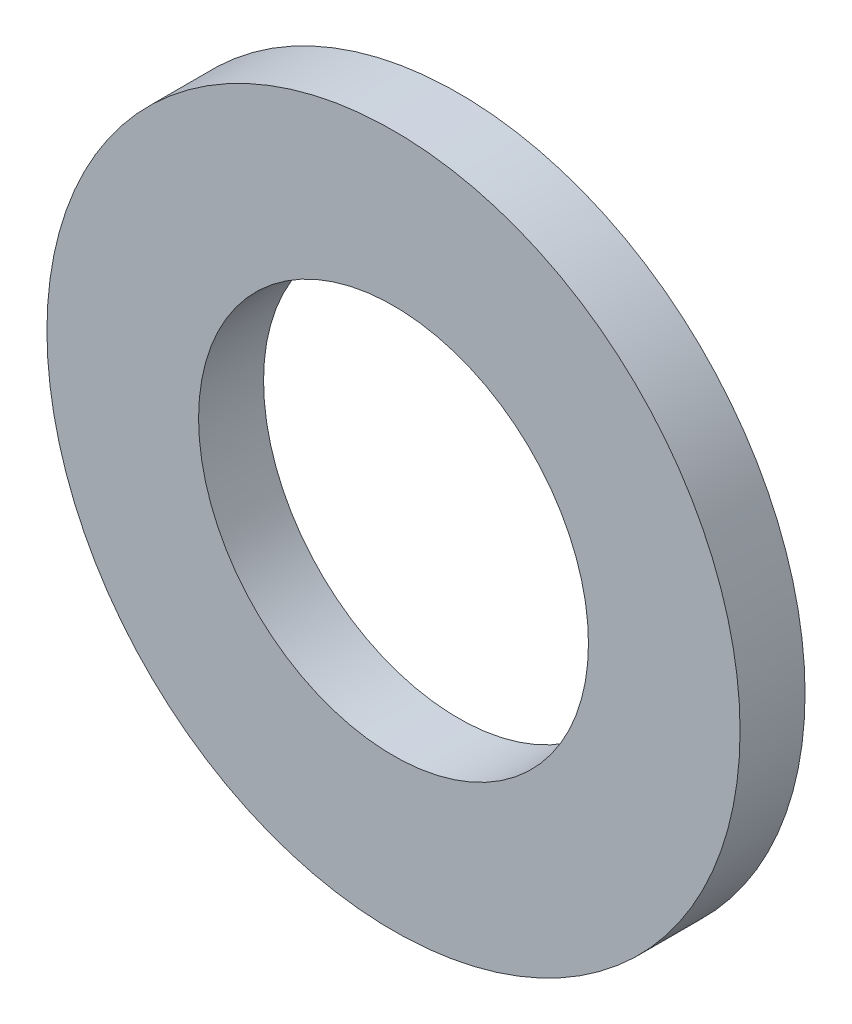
ISO-10303-21;
HEADER;
FILE_DESCRIPTION(('STEP AP214'),'2;1');
FILE_NAME('part.step','',(''),(''),'','','');
FILE_SCHEMA(('AUTOMOTIVE_DESIGN { 1 0 10303 214 1 1 1 1 }'));
ENDSEC;
DATA;
#1=APPLICATION_CONTEXT('core data for automotive mechanical design processes');
#2=APPLICATION_PROTOCOL_DEFINITION('international standard','automotive_design',2000,#1);
#3=PRODUCT_CONTEXT('',#1,'mechanical');
#4=PRODUCT('Part','Part','',(#3));
#5=PRODUCT_RELATED_PRODUCT_CATEGORY('part','',(#4));
#6=PRODUCT_DEFINITION_FORMATION('','',#4);
#7=PRODUCT_DEFINITION_CONTEXT('part definition',#1,'design');
#8=PRODUCT_DEFINITION('design','',#6,#7);
#9=PRODUCT_DEFINITION_SHAPE('','',#8);
#10=(LENGTH_UNIT() NAMED_UNIT(*) SI_UNIT(.MILLI.,.METRE.));
#11=(NAMED_UNIT(*) PLANE_ANGLE_UNIT() SI_UNIT($,.RADIAN.));
#12=(NAMED_UNIT(*) SI_UNIT($,.STERADIAN.) SOLID_ANGLE_UNIT());
#13=UNCERTAINTY_MEASURE_WITH_UNIT(LENGTH_MEASURE(1.E-05),#10,'distance_accuracy_value','');
#14=(GEOMETRIC_REPRESENTATION_CONTEXT(3) GLOBAL_UNCERTAINTY_ASSIGNED_CONTEXT((#13)) GLOBAL_UNIT_ASSIGNED_CONTEXT((#10,
#11,#12)) REPRESENTATION_CONTEXT('',''));
#15=CARTESIAN_POINT('',(0.,0.,0.));
#16=DIRECTION('',(0.,0.,1.));
#17=DIRECTION('',(1.,0.,0.));
#18=AXIS2_PLACEMENT_3D('',#15,#16,#17);
#19=CARTESIAN_POINT('',(0.,0.,-3.));
#20=DIRECTION('',(0.,0.,1.));
#21=DIRECTION('',(1.,0.,0.));
#22=AXIS2_PLACEMENT_3D('',#19,#20,#21);
#23=CYLINDRICAL_SURFACE('',#22,16.);
#24=CARTESIAN_POINT('',(0.,0.,-3.));
#25=DIRECTION('',(0.,0.,1.));
#26=DIRECTION('',(1.,0.,0.));
#27=AXIS2_PLACEMENT_3D('',#24,#25,#26);
#28=CIRCLE('',#27,16.);
#29=CARTESIAN_POINT('',(16.0000000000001,0.,-3.));
#30=VERTEX_POINT('',#29);
#31=EDGE_CURVE('E10',#30,#30,#28,.T.);
#32=ORIENTED_EDGE('',*,*,#31,.T.);
#33=EDGE_LOOP('',(#32));
#34=FACE_BOUND('',#33,.T.);
#35=CARTESIAN_POINT('',(0.,0.,0.));
#36=DIRECTION('',(0.,0.,1.));
#37=DIRECTION('',(1.,0.,0.));
#38=AXIS2_PLACEMENT_3D('',#35,#36,#37);
#39=CIRCLE('',#38,16.);
#40=CARTESIAN_POINT('',(16.0000000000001,0.,0.));
#41=VERTEX_POINT('',#40);
#42=EDGE_CURVE('E26',#41,#41,#39,.T.);
#43=ORIENTED_EDGE('',*,*,#42,.F.);
#44=EDGE_LOOP('',(#43));
#45=FACE_BOUND('',#44,.T.);
#46=ADVANCED_FACE('F20',(#34,#45),#23,.T.);
#47=CARTESIAN_POINT('',(0.,0.,-3.));
#48=DIRECTION('',(0.,0.,1.));
#49=DIRECTION('',(1.,0.,0.));
#50=AXIS2_PLACEMENT_3D('',#47,#48,#49);
#51=PLANE('',#50);
#52=CARTESIAN_POINT('',(0.,0.,-3.));
#53=DIRECTION('',(0.,0.,1.));
#54=DIRECTION('',(1.,0.,0.));
#55=AXIS2_PLACEMENT_3D('',#52,#53,#54);
#56=CIRCLE('',#55,9.);
#57=CARTESIAN_POINT('',(9.00000000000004,0.,-3.));
#58=VERTEX_POINT('',#57);
#59=EDGE_CURVE('E30',#58,#58,#56,.T.);
#60=ORIENTED_EDGE('',*,*,#59,.T.);
#61=EDGE_LOOP('',(#60));
#62=FACE_BOUND('',#61,.T.);
#63=ORIENTED_EDGE('',*,*,#31,.F.);
#64=EDGE_LOOP('',(#63));
#65=FACE_BOUND('',#64,.T.);
#66=ADVANCED_FACE('F44',(#62,#65),#51,.F.);
#67=CARTESIAN_POINT('',(0.,0.,0.));
#68=DIRECTION('',(0.,0.,1.));
#69=DIRECTION('',(1.,0.,0.));
#70=AXIS2_PLACEMENT_3D('',#67,#68,#69);
#71=PLANE('',#70);
#72=CARTESIAN_POINT('',(0.,0.,0.));
#73=DIRECTION('',(0.,0.,1.));
#74=DIRECTION('',(1.,0.,0.));
#75=AXIS2_PLACEMENT_3D('',#72,#73,#74);
#76=CIRCLE('',#75,9.);
#77=CARTESIAN_POINT('',(9.00000000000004,0.,0.));
#78=VERTEX_POINT('',#77);
#79=EDGE_CURVE('E34',#78,#78,#76,.T.);
#80=ORIENTED_EDGE('',*,*,#79,.F.);
#81=EDGE_LOOP('',(#80));
#82=FACE_BOUND('',#81,.T.);
#83=ORIENTED_EDGE('',*,*,#42,.T.);
#84=EDGE_LOOP('',(#83));
#85=FACE_BOUND('',#84,.T.);
#86=ADVANCED_FACE('F42',(#82,#85),#71,.T.);
#87=CARTESIAN_POINT('',(0.,0.,-3.));
#88=DIRECTION('',(0.,0.,1.));
#89=DIRECTION('',(1.,0.,0.));
#90=AXIS2_PLACEMENT_3D('',#87,#88,#89);
#91=CYLINDRICAL_SURFACE('',#90,9.);
#92=ORIENTED_EDGE('',*,*,#59,.F.);
#93=EDGE_LOOP('',(#92));
#94=FACE_BOUND('',#93,.T.);
#95=ORIENTED_EDGE('',*,*,#79,.T.);
#96=EDGE_LOOP('',(#95));
#97=FACE_BOUND('',#96,.T.);
#98=ADVANCED_FACE('F40',(#94,#97),#91,.F.);
#99=CLOSED_SHELL('',(#46,#66,#86,#98));
#100=MANIFOLD_SOLID_BREP('B2',#99);
#101=ADVANCED_BREP_SHAPE_REPRESENTATION('',(#18,#100),#14);
#102=SHAPE_DEFINITION_REPRESENTATION(#9,#101);
ENDSEC;
END-ISO-10303-21;
